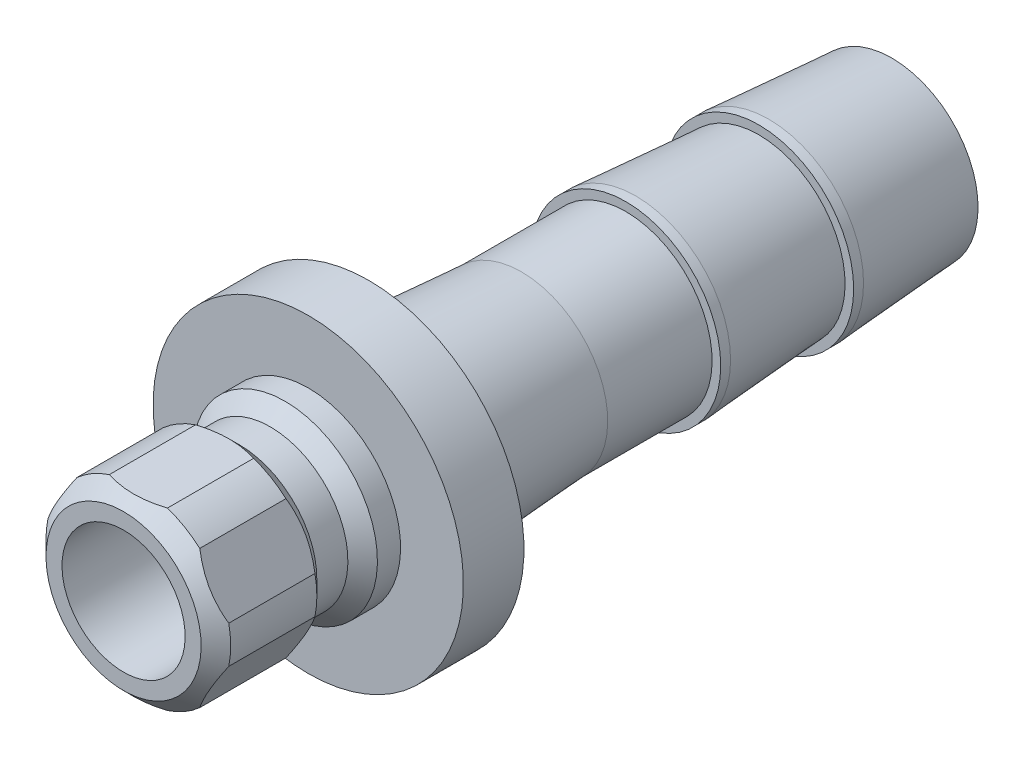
ISO-10303-21;
HEADER;
FILE_DESCRIPTION(('STEP AP214'),'2;1');
FILE_NAME('part.step','',(''),(''),'','','');
FILE_SCHEMA(('AUTOMOTIVE_DESIGN { 1 0 10303 214 1 1 1 1 }'));
ENDSEC;
DATA;
#1=APPLICATION_CONTEXT('core data for automotive mechanical design processes');
#2=APPLICATION_PROTOCOL_DEFINITION('international standard','automotive_design',2000,#1);
#3=PRODUCT_CONTEXT('',#1,'mechanical');
#4=PRODUCT('Part','Part','',(#3));
#5=PRODUCT_RELATED_PRODUCT_CATEGORY('part','',(#4));
#6=PRODUCT_DEFINITION_FORMATION('','',#4);
#7=PRODUCT_DEFINITION_CONTEXT('part definition',#1,'design');
#8=PRODUCT_DEFINITION('design','',#6,#7);
#9=PRODUCT_DEFINITION_SHAPE('','',#8);
#10=(LENGTH_UNIT() NAMED_UNIT(*) SI_UNIT(.MILLI.,.METRE.));
#11=(NAMED_UNIT(*) PLANE_ANGLE_UNIT() SI_UNIT($,.RADIAN.));
#12=(NAMED_UNIT(*) SI_UNIT($,.STERADIAN.) SOLID_ANGLE_UNIT());
#13=UNCERTAINTY_MEASURE_WITH_UNIT(LENGTH_MEASURE(1.E-05),#10,'distance_accuracy_value','');
#14=(GEOMETRIC_REPRESENTATION_CONTEXT(3) GLOBAL_UNCERTAINTY_ASSIGNED_CONTEXT((#13)) GLOBAL_UNIT_ASSIGNED_CONTEXT((#10,
#11,#12)) REPRESENTATION_CONTEXT('',''));
#15=CARTESIAN_POINT('',(0.,0.,0.));
#16=DIRECTION('',(0.,0.,1.));
#17=DIRECTION('',(1.,0.,0.));
#18=AXIS2_PLACEMENT_3D('',#15,#16,#17);
#19=CARTESIAN_POINT('',(0.,0.,8.763));
#20=DIRECTION('',(0.,0.,-1.));
#21=DIRECTION('',(0.,1.,0.));
#22=AXIS2_PLACEMENT_3D('',#19,#20,#21);
#23=CONICAL_SURFACE('',#22,4.7625,0.785398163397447);
#24=CARTESIAN_POINT('',(0.,0.,9.525));
#25=DIRECTION('',(0.,0.,-1.));
#26=DIRECTION('',(0.,1.,0.));
#27=AXIS2_PLACEMENT_3D('',#24,#25,#26);
#28=CIRCLE('',#27,4.0005);
#29=CARTESIAN_POINT('',(0.,4.0005,9.525));
#30=VERTEX_POINT('',#29);
#31=EDGE_CURVE('E162',#30,#30,#28,.T.);
#32=ORIENTED_EDGE('',*,*,#31,.T.);
#33=EDGE_LOOP('',(#32));
#34=FACE_BOUND('',#33,.T.);
#35=CARTESIAN_POINT('',(0.,0.,8.763));
#36=DIRECTION('',(0.,0.,-1.));
#37=DIRECTION('',(0.,1.,0.));
#38=AXIS2_PLACEMENT_3D('',#35,#36,#37);
#39=CIRCLE('',#38,4.7625);
#40=CARTESIAN_POINT('',(1.49671534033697,4.5212,8.763));
#41=VERTEX_POINT('',#40);
#42=CARTESIAN_POINT('',(3.16711638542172,3.55679350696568,8.763));
#43=VERTEX_POINT('',#42);
#44=EDGE_CURVE('E159',#41,#43,#39,.T.);
#45=ORIENTED_EDGE('',*,*,#44,.F.);
#46=CARTESIAN_POINT('',(-5.0602333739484,4.5212,6.73969045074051));
#47=CARTESIAN_POINT('',(-4.93634312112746,4.5212,6.83205528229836));
#48=CARTESIAN_POINT('',(-4.811743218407,4.5212,6.92348406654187));
#49=CARTESIAN_POINT('',(-4.56085059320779,4.5212,7.1040558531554));
#50=CARTESIAN_POINT('',(-4.43455743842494,4.5212,7.19319825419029));
#51=CARTESIAN_POINT('',(-4.17908222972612,4.5212,7.36941570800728));
#52=CARTESIAN_POINT('',(-4.04988536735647,4.5212,7.45646936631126));
#53=CARTESIAN_POINT('',(-3.78927482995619,4.5212,7.62718212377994));
#54=CARTESIAN_POINT('',(-3.65786131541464,4.5212,7.71084146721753));
#55=CARTESIAN_POINT('',(-3.38538701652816,4.5212,7.87838236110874));
#56=CARTESIAN_POINT('',(-3.24418594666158,4.5212,7.96203692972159));
#57=CARTESIAN_POINT('',(-2.95850534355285,4.5212,8.12363694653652));
#58=CARTESIAN_POINT('',(-2.81402531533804,4.5212,8.20158152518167));
#59=CARTESIAN_POINT('',(-2.52183304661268,4.5212,8.35006696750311));
#60=CARTESIAN_POINT('',(-2.37413195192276,4.5212,8.42062959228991));
#61=CARTESIAN_POINT('',(-2.07479760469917,4.5212,8.55277287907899));
#62=CARTESIAN_POINT('',(-1.92316611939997,4.5212,8.61435749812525));
#63=CARTESIAN_POINT('',(-1.62629805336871,4.5212,8.72254985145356));
#64=CARTESIAN_POINT('',(-1.48133250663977,4.5212,8.76989343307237));
#65=CARTESIAN_POINT('',(-1.18803884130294,4.5212,8.85292852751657));
#66=CARTESIAN_POINT('',(-1.03971047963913,4.5212,8.88861919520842));
#67=CARTESIAN_POINT('',(-0.742975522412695,4.5212,8.94593029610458));
#68=CARTESIAN_POINT('',(-0.594614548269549,4.5212,8.96778315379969));
#69=CARTESIAN_POINT('',(-0.296466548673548,4.5212,8.99701724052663));
#70=CARTESIAN_POINT('',(-0.146679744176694,4.5212,9.00440067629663));
#71=CARTESIAN_POINT('',(0.148070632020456,4.5212,9.00420046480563));
#72=CARTESIAN_POINT('',(0.293034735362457,4.5212,8.99708950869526));
#73=CARTESIAN_POINT('',(0.581648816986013,4.5212,8.96930433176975));
#74=CARTESIAN_POINT('',(0.72529866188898,4.5212,8.94862874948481));
#75=CARTESIAN_POINT('',(1.0126713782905,4.5212,8.89446534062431));
#76=CARTESIAN_POINT('',(1.15635345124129,4.5212,8.86076436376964));
#77=CARTESIAN_POINT('',(1.44060339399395,4.5212,8.78230373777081));
#78=CARTESIAN_POINT('',(1.58117157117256,4.5212,8.73754518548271));
#79=CARTESIAN_POINT('',(1.8753823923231,4.5212,8.63293184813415));
#80=CARTESIAN_POINT('',(2.02860927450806,4.5212,8.5719186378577));
#81=CARTESIAN_POINT('',(2.3310511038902,4.5212,8.44057368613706));
#82=CARTESIAN_POINT('',(2.48026409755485,4.5212,8.37023750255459));
#83=CARTESIAN_POINT('',(2.77542641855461,4.5212,8.22192506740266));
#84=CARTESIAN_POINT('',(2.92136343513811,4.5212,8.14392451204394));
#85=CARTESIAN_POINT('',(3.20986770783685,4.5212,7.98201287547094));
#86=CARTESIAN_POINT('',(3.35243550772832,4.5212,7.89810275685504));
#87=CARTESIAN_POINT('',(3.62758150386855,4.5212,7.72986772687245));
#88=CARTESIAN_POINT('',(3.76030215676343,4.5212,7.64577457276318));
#89=CARTESIAN_POINT('',(4.02346673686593,4.5212,7.47408734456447));
#90=CARTESIAN_POINT('',(4.1539104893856,4.5212,7.38649300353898));
#91=CARTESIAN_POINT('',(4.41175524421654,4.5212,7.20916168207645));
#92=CARTESIAN_POINT('',(4.5391724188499,4.5212,7.11944813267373));
#93=CARTESIAN_POINT('',(4.79227118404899,4.5212,6.93767494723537));
#94=CARTESIAN_POINT('',(4.91795324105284,4.5212,6.84561596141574));
#95=CARTESIAN_POINT('',(5.04290975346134,4.5212,6.75259898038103));
#96=B_SPLINE_CURVE_WITH_KNOTS('',3,(#46,#47,#48,#49,#50,#51,#52,#53,#54,#55,#56,#57,#58,#59,#60,
#61,#62,#63,#64,#65,#66,#67,#68,#69,#70,#71,#72,#73,#74,#75,#76,#77,#78,#79,#80,#81,#82,#83,#84,
#85,#86,#87,#88,#89,#90,#91,#92,#93,#94,#95),.UNSPECIFIED.,.F.,.F.,(4,2,2,2,2,2,2,2,2,2,2,2,2,2,
2,2,2,2,2,2,2,2,2,2,4),(0.,0.463604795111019,0.927330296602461,1.39465214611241,
1.86194030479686,2.35419709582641,2.84652869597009,3.33736544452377,3.82798519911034,
4.28507980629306,4.74220755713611,5.19143799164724,5.64059990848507,6.07534819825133,
6.51014013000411,6.9523708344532,7.39455768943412,7.88895068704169,8.38358010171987,
8.87983197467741,9.37600320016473,9.84729595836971,10.3186247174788,10.7860923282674,
11.253431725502),.UNSPECIFIED.);
#97=CARTESIAN_POINT('',(-1.49671534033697,4.5212,8.763));
#98=VERTEX_POINT('',#97);
#99=EDGE_CURVE('E320',#41,#98,#96,.F.);
#100=ORIENTED_EDGE('',*,*,#99,.T.);
#101=CARTESIAN_POINT('',(-3.16711638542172,3.55679350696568,8.763));
#102=VERTEX_POINT('',#101);
#103=EDGE_CURVE('E156',#102,#98,#39,.T.);
#104=ORIENTED_EDGE('',*,*,#103,.F.);
#105=CARTESIAN_POINT('',(-3.16679824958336,3.55734453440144,8.7628));
#106=CARTESIAN_POINT('',(-3.22352818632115,3.45908540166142,8.79849546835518));
#107=CARTESIAN_POINT('',(-3.28081452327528,3.35986255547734,8.83084024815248));
#108=CARTESIAN_POINT('',(-3.39638266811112,3.1596926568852,8.88798087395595));
#109=CARTESIAN_POINT('',(-3.45466549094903,3.0587438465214,8.91276847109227));
#110=CARTESIAN_POINT('',(-3.57062001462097,2.85790472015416,8.95338750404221));
#111=CARTESIAN_POINT('',(-3.62827437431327,2.75804443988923,8.96941393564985));
#112=CARTESIAN_POINT('',(-3.74399531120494,2.55760989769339,8.9927719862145));
#113=CARTESIAN_POINT('',(-3.80206167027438,2.45703601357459,9.0001079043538));
#114=CARTESIAN_POINT('',(-3.92728271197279,2.24014680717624,9.00622652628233));
#115=CARTESIAN_POINT('',(-3.99445711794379,2.1237973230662,9.00351464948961));
#116=CARTESIAN_POINT('',(-4.12846972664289,1.89168067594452,8.98624900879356));
#117=CARTESIAN_POINT('',(-4.19530762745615,1.77591403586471,8.97168604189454));
#118=CARTESIAN_POINT('',(-4.32994932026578,1.54270778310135,8.93091274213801));
#119=CARTESIAN_POINT('',(-4.39772926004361,1.42530948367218,8.90439364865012));
#120=CARTESIAN_POINT('',(-4.53197617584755,1.19278700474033,8.84101293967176));
#121=CARTESIAN_POINT('',(-4.59844486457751,1.07765985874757,8.80416592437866));
#122=CARTESIAN_POINT('',(-4.66414986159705,0.963855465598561,8.7628));
#123=B_SPLINE_CURVE_WITH_KNOTS('',3,(#105,#106,#107,#108,#109,#110,#111,#112,#113,#114,#115,
#116,#117,#118,#119,#120,#121,#122),.UNSPECIFIED.,.F.,.F.,(4,2,2,2,2,2,2,2,4),(0.,
0.356859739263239,0.714107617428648,1.06304196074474,1.41180361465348,1.81438443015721,
2.21727816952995,2.63123184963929,3.04460326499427),.UNSPECIFIED.);
#124=CARTESIAN_POINT('',(-4.66383172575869,0.964406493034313,8.763));
#125=VERTEX_POINT('',#124);
#126=EDGE_CURVE('E191',#102,#125,#123,.T.);
#127=ORIENTED_EDGE('',*,*,#126,.T.);
#128=CARTESIAN_POINT('',(-4.66383172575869,-0.964406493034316,8.763));
#129=VERTEX_POINT('',#128);
#130=EDGE_CURVE('E143',#129,#125,#39,.T.);
#131=ORIENTED_EDGE('',*,*,#130,.F.);
#132=CARTESIAN_POINT('',(-4.66414986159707,-0.963855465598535,8.76279999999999));
#133=CARTESIAN_POINT('',(-4.60741992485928,-1.06211459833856,8.79849546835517));
#134=CARTESIAN_POINT('',(-4.55013358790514,-1.16133744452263,8.83084024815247));
#135=CARTESIAN_POINT('',(-4.4345654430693,-1.36150734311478,8.88798087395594));
#136=CARTESIAN_POINT('',(-4.37628262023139,-1.46245615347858,8.91276847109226));
#137=CARTESIAN_POINT('',(-4.26032809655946,-1.66329527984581,8.95338750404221));
#138=CARTESIAN_POINT('',(-4.20267373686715,-1.76315556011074,8.96941393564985));
#139=CARTESIAN_POINT('',(-4.08695279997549,-1.96359010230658,8.9927719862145));
#140=CARTESIAN_POINT('',(-4.02888644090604,-2.06416398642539,9.0001079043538));
#141=CARTESIAN_POINT('',(-3.90366539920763,-2.28105319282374,9.00622652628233));
#142=CARTESIAN_POINT('',(-3.83649099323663,-2.39740267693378,9.00351464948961));
#143=CARTESIAN_POINT('',(-3.70247838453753,-2.62951932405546,8.98624900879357));
#144=CARTESIAN_POINT('',(-3.63564048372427,-2.74528596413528,8.97168604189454));
#145=CARTESIAN_POINT('',(-3.50099879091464,-2.97849221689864,8.93091274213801));
#146=CARTESIAN_POINT('',(-3.4332188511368,-3.09589051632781,8.90439364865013));
#147=CARTESIAN_POINT('',(-3.29897193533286,-3.32841299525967,8.84101293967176));
#148=CARTESIAN_POINT('',(-3.2325032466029,-3.44354014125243,8.80416592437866));
#149=CARTESIAN_POINT('',(-3.16679824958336,-3.55734453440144,8.7628));
#150=B_SPLINE_CURVE_WITH_KNOTS('',3,(#132,#133,#134,#135,#136,#137,#138,#139,#140,#141,#142,
#143,#144,#145,#146,#147,#148,#149),.UNSPECIFIED.,.F.,.F.,(4,2,2,2,2,2,2,2,4),(0.,
0.356859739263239,0.714107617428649,1.06304196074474,1.41180361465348,1.81438443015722,
2.21727816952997,2.63123184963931,3.0446032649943),.UNSPECIFIED.);
#151=CARTESIAN_POINT('',(-3.16711638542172,-3.55679350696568,8.763));
#152=VERTEX_POINT('',#151);
#153=EDGE_CURVE('E211',#129,#152,#150,.T.);
#154=ORIENTED_EDGE('',*,*,#153,.T.);
#155=CARTESIAN_POINT('',(-1.49671534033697,-4.5212,8.763));
#156=VERTEX_POINT('',#155);
#157=EDGE_CURVE('E289',#156,#152,#39,.T.);
#158=ORIENTED_EDGE('',*,*,#157,.F.);
#159=CARTESIAN_POINT('',(-5.0602333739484,-4.5212,6.73969045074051));
#160=CARTESIAN_POINT('',(-4.93634312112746,-4.5212,6.83205528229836));
#161=CARTESIAN_POINT('',(-4.81174321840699,-4.5212,6.92348406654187));
#162=CARTESIAN_POINT('',(-4.56085059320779,-4.5212,7.1040558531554));
#163=CARTESIAN_POINT('',(-4.43455743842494,-4.5212,7.19319825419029));
#164=CARTESIAN_POINT('',(-4.17908222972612,-4.5212,7.36941570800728));
#165=CARTESIAN_POINT('',(-4.04988536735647,-4.5212,7.45646936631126));
#166=CARTESIAN_POINT('',(-3.78927482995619,-4.5212,7.62718212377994));
#167=CARTESIAN_POINT('',(-3.65786131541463,-4.5212,7.71084146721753));
#168=CARTESIAN_POINT('',(-3.38538701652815,-4.5212,7.87838236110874));
#169=CARTESIAN_POINT('',(-3.24418594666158,-4.5212,7.96203692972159));
#170=CARTESIAN_POINT('',(-2.95850534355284,-4.5212,8.12363694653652));
#171=CARTESIAN_POINT('',(-2.81402531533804,-4.5212,8.20158152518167));
#172=CARTESIAN_POINT('',(-2.52183304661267,-4.5212,8.35006696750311));
#173=CARTESIAN_POINT('',(-2.37413195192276,-4.5212,8.42062959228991));
#174=CARTESIAN_POINT('',(-2.07479760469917,-4.5212,8.55277287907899));
#175=CARTESIAN_POINT('',(-1.92316611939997,-4.5212,8.61435749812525));
#176=CARTESIAN_POINT('',(-1.62629805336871,-4.5212,8.72254985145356));
#177=CARTESIAN_POINT('',(-1.48133250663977,-4.5212,8.76989343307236));
#178=CARTESIAN_POINT('',(-1.18803884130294,-4.5212,8.85292852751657));
#179=CARTESIAN_POINT('',(-1.03971047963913,-4.5212,8.88861919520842));
#180=CARTESIAN_POINT('',(-0.742975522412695,-4.5212,8.94593029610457));
#181=CARTESIAN_POINT('',(-0.594614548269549,-4.5212,8.96778315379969));
#182=CARTESIAN_POINT('',(-0.296466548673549,-4.5212,8.99701724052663));
#183=CARTESIAN_POINT('',(-0.146679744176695,-4.5212,9.00440067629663));
#184=CARTESIAN_POINT('',(0.148070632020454,-4.5212,9.00420046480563));
#185=CARTESIAN_POINT('',(0.293034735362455,-4.5212,8.99708950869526));
#186=CARTESIAN_POINT('',(0.581648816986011,-4.5212,8.96930433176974));
#187=CARTESIAN_POINT('',(0.725298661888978,-4.5212,8.94862874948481));
#188=CARTESIAN_POINT('',(1.0126713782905,-4.5212,8.89446534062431));
#189=CARTESIAN_POINT('',(1.15635345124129,-4.5212,8.86076436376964));
#190=CARTESIAN_POINT('',(1.44060339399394,-4.5212,8.78230373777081));
#191=CARTESIAN_POINT('',(1.58117157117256,-4.5212,8.73754518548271));
#192=CARTESIAN_POINT('',(1.8753823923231,-4.5212,8.63293184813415));
#193=CARTESIAN_POINT('',(2.02860927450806,-4.5212,8.5719186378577));
#194=CARTESIAN_POINT('',(2.3310511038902,-4.5212,8.44057368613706));
#195=CARTESIAN_POINT('',(2.48026409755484,-4.5212,8.37023750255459));
#196=CARTESIAN_POINT('',(2.77542641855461,-4.5212,8.22192506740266));
#197=CARTESIAN_POINT('',(2.9213634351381,-4.5212,8.14392451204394));
#198=CARTESIAN_POINT('',(3.20986770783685,-4.5212,7.98201287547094));
#199=CARTESIAN_POINT('',(3.35243550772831,-4.5212,7.89810275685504));
#200=CARTESIAN_POINT('',(3.62758150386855,-4.5212,7.72986772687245));
#201=CARTESIAN_POINT('',(3.76030215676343,-4.5212,7.64577457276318));
#202=CARTESIAN_POINT('',(4.02346673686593,-4.5212,7.47408734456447));
#203=CARTESIAN_POINT('',(4.15391048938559,-4.5212,7.38649300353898));
#204=CARTESIAN_POINT('',(4.41175524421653,-4.5212,7.20916168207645));
#205=CARTESIAN_POINT('',(4.5391724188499,-4.5212,7.11944813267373));
#206=CARTESIAN_POINT('',(4.79227118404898,-4.5212,6.93767494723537));
#207=CARTESIAN_POINT('',(4.91795324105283,-4.5212,6.84561596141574));
#208=CARTESIAN_POINT('',(5.04290975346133,-4.5212,6.75259898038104));
#209=B_SPLINE_CURVE_WITH_KNOTS('',3,(#159,#160,#161,#162,#163,#164,#165,#166,#167,#168,#169,
#170,#171,#172,#173,#174,#175,#176,#177,#178,#179,#180,#181,#182,#183,#184,#185,#186,#187,#188,
#189,#190,#191,#192,#193,#194,#195,#196,#197,#198,#199,#200,#201,#202,#203,#204,#205,#206,#207,
#208),.UNSPECIFIED.,.F.,.F.,(4,2,2,2,2,2,2,2,2,2,2,2,2,2,2,2,2,2,2,2,2,2,2,2,4),(0.,
0.463604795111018,0.927330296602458,1.3946521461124,1.86194030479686,2.35419709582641,
2.84652869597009,3.33736544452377,3.82798519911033,4.28507980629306,4.74220755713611,
5.19143799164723,5.64059990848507,6.07534819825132,6.5101401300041,6.95237083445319,
7.39455768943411,7.88895068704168,8.38358010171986,8.8798319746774,9.37600320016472,
9.8472959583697,10.3186247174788,10.7860923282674,11.2534317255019),.UNSPECIFIED.);
#210=CARTESIAN_POINT('',(1.49671534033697,-4.5212,8.763));
#211=VERTEX_POINT('',#210);
#212=EDGE_CURVE('E218',#156,#211,#209,.T.);
#213=ORIENTED_EDGE('',*,*,#212,.T.);
#214=CARTESIAN_POINT('',(3.16711638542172,-3.55679350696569,8.763));
#215=VERTEX_POINT('',#214);
#216=EDGE_CURVE('E297',#215,#211,#39,.T.);
#217=ORIENTED_EDGE('',*,*,#216,.F.);
#218=CARTESIAN_POINT('',(3.16679824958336,-3.55734453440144,8.7628));
#219=CARTESIAN_POINT('',(3.22352818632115,-3.45908540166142,8.79849546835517));
#220=CARTESIAN_POINT('',(3.28081452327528,-3.35986255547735,8.83084024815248));
#221=CARTESIAN_POINT('',(3.39638266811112,-3.1596926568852,8.88798087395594));
#222=CARTESIAN_POINT('',(3.45466549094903,-3.0587438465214,8.91276847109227));
#223=CARTESIAN_POINT('',(3.57062001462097,-2.85790472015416,8.95338750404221));
#224=CARTESIAN_POINT('',(3.62827437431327,-2.75804443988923,8.96941393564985));
#225=CARTESIAN_POINT('',(3.74399531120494,-2.5576098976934,8.9927719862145));
#226=CARTESIAN_POINT('',(3.80206167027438,-2.45703601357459,9.0001079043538));
#227=CARTESIAN_POINT('',(3.92728271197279,-2.24014680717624,9.00622652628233));
#228=CARTESIAN_POINT('',(3.9944571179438,-2.1237973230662,9.00351464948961));
#229=CARTESIAN_POINT('',(4.1284697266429,-1.89168067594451,8.98624900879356));
#230=CARTESIAN_POINT('',(4.19530762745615,-1.7759140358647,8.97168604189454));
#231=CARTESIAN_POINT('',(4.32994932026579,-1.54270778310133,8.93091274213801));
#232=CARTESIAN_POINT('',(4.39772926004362,-1.42530948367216,8.90439364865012));
#233=CARTESIAN_POINT('',(4.53197617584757,-1.19278700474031,8.84101293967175));
#234=CARTESIAN_POINT('',(4.59844486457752,-1.07765985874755,8.80416592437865));
#235=CARTESIAN_POINT('',(4.66414986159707,-0.963855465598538,8.76279999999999));
#236=B_SPLINE_CURVE_WITH_KNOTS('',3,(#218,#219,#220,#221,#222,#223,#224,#225,#226,#227,#228,
#229,#230,#231,#232,#233,#234,#235),.UNSPECIFIED.,.F.,.F.,(4,2,2,2,2,2,2,2,4),(0.,
0.356859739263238,0.714107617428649,1.06304196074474,1.41180361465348,1.81438443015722,
2.21727816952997,2.63123184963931,3.0446032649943),.UNSPECIFIED.);
#237=CARTESIAN_POINT('',(4.66383172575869,-0.964406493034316,8.763));
#238=VERTEX_POINT('',#237);
#239=EDGE_CURVE('E225',#215,#238,#236,.T.);
#240=ORIENTED_EDGE('',*,*,#239,.T.);
#241=CARTESIAN_POINT('',(4.66383172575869,0.964406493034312,8.763));
#242=VERTEX_POINT('',#241);
#243=EDGE_CURVE('E163',#242,#238,#39,.T.);
#244=ORIENTED_EDGE('',*,*,#243,.F.);
#245=CARTESIAN_POINT('',(4.66414986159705,0.963855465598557,8.7628));
#246=CARTESIAN_POINT('',(4.60741992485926,1.06211459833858,8.79849546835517));
#247=CARTESIAN_POINT('',(4.55013358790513,1.16133744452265,8.83084024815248));
#248=CARTESIAN_POINT('',(4.43456544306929,1.3615073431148,8.88798087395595));
#249=CARTESIAN_POINT('',(4.37628262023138,1.4624561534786,8.91276847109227));
#250=CARTESIAN_POINT('',(4.26032809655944,1.66329527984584,8.95338750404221));
#251=CARTESIAN_POINT('',(4.20267373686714,1.76315556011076,8.96941393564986));
#252=CARTESIAN_POINT('',(4.08695279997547,1.9635901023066,8.99277198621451));
#253=CARTESIAN_POINT('',(4.02888644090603,2.06416398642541,9.0001079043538));
#254=CARTESIAN_POINT('',(3.90366539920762,2.28105319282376,9.00622652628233));
#255=CARTESIAN_POINT('',(3.83649099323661,2.3974026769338,9.00351464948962));
#256=CARTESIAN_POINT('',(3.70247838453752,2.62951932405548,8.98624900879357));
#257=CARTESIAN_POINT('',(3.63564048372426,2.74528596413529,8.97168604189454));
#258=CARTESIAN_POINT('',(3.50099879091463,2.97849221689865,8.93091274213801));
#259=CARTESIAN_POINT('',(3.43321885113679,3.09589051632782,8.90439364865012));
#260=CARTESIAN_POINT('',(3.29897193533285,3.32841299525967,8.84101293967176));
#261=CARTESIAN_POINT('',(3.2325032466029,3.44354014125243,8.80416592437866));
#262=CARTESIAN_POINT('',(3.16679824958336,3.55734453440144,8.7628));
#263=B_SPLINE_CURVE_WITH_KNOTS('',3,(#245,#246,#247,#248,#249,#250,#251,#252,#253,#254,#255,
#256,#257,#258,#259,#260,#261,#262),.UNSPECIFIED.,.F.,.F.,(4,2,2,2,2,2,2,2,4),(0.,
0.356859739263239,0.714107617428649,1.06304196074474,1.41180361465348,1.81438443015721,
2.21727816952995,2.63123184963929,3.04460326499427),.UNSPECIFIED.);
#264=EDGE_CURVE('E233',#242,#43,#263,.T.);
#265=ORIENTED_EDGE('',*,*,#264,.T.);
#266=EDGE_LOOP('',(#45,#100,#104,#127,#131,#154,#158,#213,#217,#240,#244,#265));
#267=FACE_BOUND('',#266,.T.);
#268=ADVANCED_FACE('F34',(#34,#267),#23,.T.);
#269=CARTESIAN_POINT('',(0.,0.,0.));
#270=DIRECTION('',(0.,0.,-1.));
#271=DIRECTION('',(0.,1.,0.));
#272=AXIS2_PLACEMENT_3D('',#269,#270,#271);
#273=CYLINDRICAL_SURFACE('',#272,4.7625);
#274=CARTESIAN_POINT('',(0.,0.,4.318));
#275=DIRECTION('',(0.,0.,-1.));
#276=DIRECTION('',(0.,1.,0.));
#277=AXIS2_PLACEMENT_3D('',#274,#275,#276);
#278=CIRCLE('',#277,4.7625);
#279=CARTESIAN_POINT('',(1.49671534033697,4.5212,4.318));
#280=VERTEX_POINT('',#279);
#281=CARTESIAN_POINT('',(3.16711638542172,3.55679350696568,4.318));
#282=VERTEX_POINT('',#281);
#283=EDGE_CURVE('E152',#280,#282,#278,.T.);
#284=ORIENTED_EDGE('',*,*,#283,.F.);
#285=DIRECTION('',(0.,0.,-1.));
#286=VECTOR('',#285,1.);
#287=CARTESIAN_POINT('',(1.49671534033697,4.5212,0.));
#288=LINE('',#287,#286);
#289=EDGE_CURVE('E324',#280,#41,#288,.F.);
#290=ORIENTED_EDGE('',*,*,#289,.T.);
#291=ORIENTED_EDGE('',*,*,#44,.T.);
#292=DIRECTION('',(0.,0.,-1.));
#293=VECTOR('',#292,1.);
#294=CARTESIAN_POINT('',(3.16711638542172,3.55679350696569,0.));
#295=LINE('',#294,#293);
#296=EDGE_CURVE('E307',#43,#282,#295,.T.);
#297=ORIENTED_EDGE('',*,*,#296,.T.);
#298=EDGE_LOOP('',(#284,#290,#291,#297));
#299=FACE_BOUND('',#298,.T.);
#300=ADVANCED_FACE('F202',(#299),#273,.T.);
#301=ORIENTED_EDGE('',*,*,#103,.T.);
#302=DIRECTION('',(0.,0.,-1.));
#303=VECTOR('',#302,1.);
#304=CARTESIAN_POINT('',(-1.49671534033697,4.5212,0.));
#305=LINE('',#304,#303);
#306=CARTESIAN_POINT('',(-1.4967153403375,4.5212,4.31799999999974));
#307=VERTEX_POINT('',#306);
#308=EDGE_CURVE('E241',#98,#307,#305,.T.);
#309=ORIENTED_EDGE('',*,*,#308,.T.);
#310=CARTESIAN_POINT('',(-3.16711638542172,3.55679350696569,4.318));
#311=VERTEX_POINT('',#310);
#312=EDGE_CURVE('E148',#311,#307,#278,.T.);
#313=ORIENTED_EDGE('',*,*,#312,.F.);
#314=DIRECTION('',(0.,0.,-1.));
#315=VECTOR('',#314,1.);
#316=CARTESIAN_POINT('',(-3.16711638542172,3.55679350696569,0.));
#317=LINE('',#316,#315);
#318=EDGE_CURVE('E54',#311,#102,#317,.F.);
#319=ORIENTED_EDGE('',*,*,#318,.T.);
#320=EDGE_LOOP('',(#301,#309,#313,#319));
#321=FACE_BOUND('',#320,.T.);
#322=ADVANCED_FACE('F318',(#321),#273,.T.);
#323=CARTESIAN_POINT('',(4.66383172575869,0.964406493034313,4.318));
#324=VERTEX_POINT('',#323);
#325=CARTESIAN_POINT('',(4.66383172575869,-0.964406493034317,4.318));
#326=VERTEX_POINT('',#325);
#327=EDGE_CURVE('E157',#324,#326,#278,.T.);
#328=ORIENTED_EDGE('',*,*,#327,.F.);
#329=DIRECTION('',(0.,0.,-1.));
#330=VECTOR('',#329,1.);
#331=CARTESIAN_POINT('',(4.66383172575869,0.964406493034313,0.));
#332=LINE('',#331,#330);
#333=EDGE_CURVE('E242',#324,#242,#332,.F.);
#334=ORIENTED_EDGE('',*,*,#333,.T.);
#335=ORIENTED_EDGE('',*,*,#243,.T.);
#336=DIRECTION('',(0.,0.,-1.));
#337=VECTOR('',#336,1.);
#338=CARTESIAN_POINT('',(4.66383172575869,-0.964406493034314,0.));
#339=LINE('',#338,#337);
#340=EDGE_CURVE('E300',#238,#326,#339,.T.);
#341=ORIENTED_EDGE('',*,*,#340,.T.);
#342=EDGE_LOOP('',(#328,#334,#335,#341));
#343=FACE_BOUND('',#342,.T.);
#344=ADVANCED_FACE('F313',(#343),#273,.T.);
#345=CARTESIAN_POINT('',(3.16711638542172,-3.55679350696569,4.318));
#346=VERTEX_POINT('',#345);
#347=CARTESIAN_POINT('',(1.49671534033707,-4.5212,4.31799999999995));
#348=VERTEX_POINT('',#347);
#349=EDGE_CURVE('E150',#346,#348,#278,.T.);
#350=ORIENTED_EDGE('',*,*,#349,.F.);
#351=DIRECTION('',(0.,0.,-1.));
#352=VECTOR('',#351,1.);
#353=CARTESIAN_POINT('',(3.16711638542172,-3.55679350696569,0.));
#354=LINE('',#353,#352);
#355=EDGE_CURVE('E302',#346,#215,#354,.F.);
#356=ORIENTED_EDGE('',*,*,#355,.T.);
#357=ORIENTED_EDGE('',*,*,#216,.T.);
#358=DIRECTION('',(0.,0.,-1.));
#359=VECTOR('',#358,1.);
#360=CARTESIAN_POINT('',(1.49671534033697,-4.5212,0.));
#361=LINE('',#360,#359);
#362=EDGE_CURVE('E284',#211,#348,#361,.T.);
#363=ORIENTED_EDGE('',*,*,#362,.T.);
#364=EDGE_LOOP('',(#350,#356,#357,#363));
#365=FACE_BOUND('',#364,.T.);
#366=ADVANCED_FACE('F294',(#365),#273,.T.);
#367=CARTESIAN_POINT('',(-1.49671534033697,-4.5212,4.318));
#368=VERTEX_POINT('',#367);
#369=CARTESIAN_POINT('',(-3.16711638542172,-3.55679350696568,4.318));
#370=VERTEX_POINT('',#369);
#371=EDGE_CURVE('E147',#368,#370,#278,.T.);
#372=ORIENTED_EDGE('',*,*,#371,.F.);
#373=DIRECTION('',(0.,0.,-1.));
#374=VECTOR('',#373,1.);
#375=CARTESIAN_POINT('',(-1.49671534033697,-4.5212,0.));
#376=LINE('',#375,#374);
#377=EDGE_CURVE('E277',#368,#156,#376,.F.);
#378=ORIENTED_EDGE('',*,*,#377,.T.);
#379=ORIENTED_EDGE('',*,*,#157,.T.);
#380=DIRECTION('',(0.,0.,-1.));
#381=VECTOR('',#380,1.);
#382=CARTESIAN_POINT('',(-3.16711638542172,-3.55679350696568,0.));
#383=LINE('',#382,#381);
#384=EDGE_CURVE('E198',#152,#370,#383,.T.);
#385=ORIENTED_EDGE('',*,*,#384,.T.);
#386=EDGE_LOOP('',(#372,#378,#379,#385));
#387=FACE_BOUND('',#386,.T.);
#388=ADVANCED_FACE('F288',(#387),#273,.T.);
#389=CARTESIAN_POINT('',(-4.66383172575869,-0.964406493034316,4.318));
#390=VERTEX_POINT('',#389);
#391=CARTESIAN_POINT('',(-4.66383172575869,0.964406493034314,4.318));
#392=VERTEX_POINT('',#391);
#393=EDGE_CURVE('E141',#390,#392,#278,.T.);
#394=ORIENTED_EDGE('',*,*,#393,.F.);
#395=DIRECTION('',(0.,0.,-1.));
#396=VECTOR('',#395,1.);
#397=CARTESIAN_POINT('',(-4.66383172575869,-0.964406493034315,0.));
#398=LINE('',#397,#396);
#399=EDGE_CURVE('E62',#390,#129,#398,.F.);
#400=ORIENTED_EDGE('',*,*,#399,.T.);
#401=ORIENTED_EDGE('',*,*,#130,.T.);
#402=DIRECTION('',(0.,0.,-1.));
#403=VECTOR('',#402,1.);
#404=CARTESIAN_POINT('',(-4.66383172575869,0.964406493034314,0.));
#405=LINE('',#404,#403);
#406=EDGE_CURVE('E128',#125,#392,#405,.T.);
#407=ORIENTED_EDGE('',*,*,#406,.T.);
#408=EDGE_LOOP('',(#394,#400,#401,#407));
#409=FACE_BOUND('',#408,.T.);
#410=ADVANCED_FACE('F140',(#409),#273,.T.);
#411=CARTESIAN_POINT('',(0.,0.,3.556));
#412=DIRECTION('',(0.,0.,1.));
#413=DIRECTION('',(0.,-1.,0.));
#414=AXIS2_PLACEMENT_3D('',#411,#412,#413);
#415=CONICAL_SURFACE('',#414,4.0005,0.785398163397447);
#416=CARTESIAN_POINT('',(0.,0.,3.556));
#417=DIRECTION('',(0.,0.,-1.));
#418=DIRECTION('',(0.,1.,0.));
#419=AXIS2_PLACEMENT_3D('',#416,#417,#418);
#420=CIRCLE('',#419,4.0005);
#421=CARTESIAN_POINT('',(0.,4.0005,3.556));
#422=VERTEX_POINT('',#421);
#423=EDGE_CURVE('E151',#422,#422,#420,.T.);
#424=ORIENTED_EDGE('',*,*,#423,.F.);
#425=EDGE_LOOP('',(#424));
#426=FACE_BOUND('',#425,.T.);
#427=ORIENTED_EDGE('',*,*,#312,.T.);
#428=CARTESIAN_POINT('',(-5.0602333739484,4.5212,6.34130954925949));
#429=CARTESIAN_POINT('',(-4.93634312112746,4.5212,6.24894471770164));
#430=CARTESIAN_POINT('',(-4.811743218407,4.5212,6.15751593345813));
#431=CARTESIAN_POINT('',(-4.56085059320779,4.5212,5.9769441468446));
#432=CARTESIAN_POINT('',(-4.43455743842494,4.5212,5.88780174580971));
#433=CARTESIAN_POINT('',(-4.17908222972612,4.5212,5.71158429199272));
#434=CARTESIAN_POINT('',(-4.04988536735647,4.5212,5.62453063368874));
#435=CARTESIAN_POINT('',(-3.78927482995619,4.5212,5.45381787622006));
#436=CARTESIAN_POINT('',(-3.65786131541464,4.5212,5.37015853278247));
#437=CARTESIAN_POINT('',(-3.38538701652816,4.5212,5.20261763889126));
#438=CARTESIAN_POINT('',(-3.24418594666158,4.5212,5.11896307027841));
#439=CARTESIAN_POINT('',(-2.95850534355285,4.5212,4.95736305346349));
#440=CARTESIAN_POINT('',(-2.81402531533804,4.5212,4.87941847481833));
#441=CARTESIAN_POINT('',(-2.52183304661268,4.5212,4.73093303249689));
#442=CARTESIAN_POINT('',(-2.37413195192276,4.5212,4.66037040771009));
#443=CARTESIAN_POINT('',(-2.07479760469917,4.5212,4.52822712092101));
#444=CARTESIAN_POINT('',(-1.92316611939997,4.5212,4.46664250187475));
#445=CARTESIAN_POINT('',(-1.62629805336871,4.5212,4.35845014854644));
#446=CARTESIAN_POINT('',(-1.48133250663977,4.5212,4.31110656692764));
#447=CARTESIAN_POINT('',(-1.18803884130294,4.5212,4.22807147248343));
#448=CARTESIAN_POINT('',(-1.03971047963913,4.5212,4.19238080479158));
#449=CARTESIAN_POINT('',(-0.742975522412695,4.5212,4.13506970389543));
#450=CARTESIAN_POINT('',(-0.594614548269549,4.5212,4.11321684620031));
#451=CARTESIAN_POINT('',(-0.296466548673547,4.5212,4.08398275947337));
#452=CARTESIAN_POINT('',(-0.146679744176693,4.5212,4.07659932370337));
#453=CARTESIAN_POINT('',(0.148070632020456,4.5212,4.07679953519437));
#454=CARTESIAN_POINT('',(0.293034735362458,4.5212,4.08391049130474));
#455=CARTESIAN_POINT('',(0.581648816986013,4.5212,4.11169566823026));
#456=CARTESIAN_POINT('',(0.72529866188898,4.5212,4.13237125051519));
#457=CARTESIAN_POINT('',(1.0126713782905,4.5212,4.18653465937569));
#458=CARTESIAN_POINT('',(1.15635345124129,4.5212,4.22023563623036));
#459=CARTESIAN_POINT('',(1.44060339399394,4.5212,4.29869626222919));
#460=CARTESIAN_POINT('',(1.58117157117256,4.5212,4.34345481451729));
#461=CARTESIAN_POINT('',(1.8753823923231,4.5212,4.44806815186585));
#462=CARTESIAN_POINT('',(2.02860927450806,4.5212,4.5090813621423));
#463=CARTESIAN_POINT('',(2.3310511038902,4.5212,4.64042631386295));
#464=CARTESIAN_POINT('',(2.48026409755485,4.5212,4.71076249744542));
#465=CARTESIAN_POINT('',(2.77542641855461,4.5212,4.85907493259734));
#466=CARTESIAN_POINT('',(2.92136343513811,4.5212,4.93707548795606));
#467=CARTESIAN_POINT('',(3.20986770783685,4.5212,5.09898712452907));
#468=CARTESIAN_POINT('',(3.35243550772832,4.5212,5.18289724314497));
#469=CARTESIAN_POINT('',(3.62758150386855,4.5212,5.35113227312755));
#470=CARTESIAN_POINT('',(3.76030215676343,4.5212,5.43522542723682));
#471=CARTESIAN_POINT('',(4.02346673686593,4.5212,5.60691265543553));
#472=CARTESIAN_POINT('',(4.1539104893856,4.5212,5.69450699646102));
#473=CARTESIAN_POINT('',(4.41175524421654,4.5212,5.87183831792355));
#474=CARTESIAN_POINT('',(4.5391724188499,4.5212,5.96155186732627));
#475=CARTESIAN_POINT('',(4.79227118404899,4.5212,6.14332505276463));
#476=CARTESIAN_POINT('',(4.91795324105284,4.5212,6.23538403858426));
#477=CARTESIAN_POINT('',(5.04290975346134,4.5212,6.32840101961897));
#478=B_SPLINE_CURVE_WITH_KNOTS('',3,(#428,#429,#430,#431,#432,#433,#434,#435,#436,#437,#438,
#439,#440,#441,#442,#443,#444,#445,#446,#447,#448,#449,#450,#451,#452,#453,#454,#455,#456,#457,
#458,#459,#460,#461,#462,#463,#464,#465,#466,#467,#468,#469,#470,#471,#472,#473,#474,#475,#476,
#477),.UNSPECIFIED.,.F.,.F.,(4,2,2,2,2,2,2,2,2,2,2,2,2,2,2,2,2,2,2,2,2,2,2,2,4),(0.,
0.463604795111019,0.92733029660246,1.39465214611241,1.86194030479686,2.35419709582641,
2.84652869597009,3.33736544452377,3.82798519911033,4.28507980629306,4.74220755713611,
5.19143799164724,5.64059990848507,6.07534819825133,6.51014013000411,6.9523708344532,
7.39455768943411,7.88895068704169,8.38358010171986,8.87983197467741,9.37600320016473,
9.84729595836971,10.3186247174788,10.7860923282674,11.253431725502),.UNSPECIFIED.);
#479=EDGE_CURVE('E12',#307,#280,#478,.T.);
#480=ORIENTED_EDGE('',*,*,#479,.T.);
#481=ORIENTED_EDGE('',*,*,#283,.T.);
#482=CARTESIAN_POINT('',(3.16679824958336,3.55734453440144,4.3182));
#483=CARTESIAN_POINT('',(3.22352818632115,3.45908540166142,4.28250453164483));
#484=CARTESIAN_POINT('',(3.28081452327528,3.35986255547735,4.25015975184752));
#485=CARTESIAN_POINT('',(3.39638266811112,3.1596926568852,4.19301912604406));
#486=CARTESIAN_POINT('',(3.45466549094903,3.0587438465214,4.16823152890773));
#487=CARTESIAN_POINT('',(3.57062001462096,2.85790472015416,4.12761249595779));
#488=CARTESIAN_POINT('',(3.62827437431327,2.75804443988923,4.11158606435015));
#489=CARTESIAN_POINT('',(3.74399531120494,2.5576098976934,4.0882280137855));
#490=CARTESIAN_POINT('',(3.80206167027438,2.45703601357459,4.0808920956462));
#491=CARTESIAN_POINT('',(3.92728271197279,2.24014680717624,4.07477347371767));
#492=CARTESIAN_POINT('',(3.99445711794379,2.1237973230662,4.07748535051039));
#493=CARTESIAN_POINT('',(4.12846972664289,1.89168067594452,4.09475099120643));
#494=CARTESIAN_POINT('',(4.19530762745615,1.77591403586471,4.10931395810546));
#495=CARTESIAN_POINT('',(4.32994932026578,1.54270778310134,4.15008725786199));
#496=CARTESIAN_POINT('',(4.39772926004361,1.42530948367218,4.17660635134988));
#497=CARTESIAN_POINT('',(4.53197617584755,1.19278700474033,4.23998706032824));
#498=CARTESIAN_POINT('',(4.59844486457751,1.07765985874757,4.27683407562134));
#499=CARTESIAN_POINT('',(4.66414986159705,0.963855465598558,4.3182));
#500=B_SPLINE_CURVE_WITH_KNOTS('',3,(#482,#483,#484,#485,#486,#487,#488,#489,#490,#491,#492,
#493,#494,#495,#496,#497,#498,#499),.UNSPECIFIED.,.F.,.F.,(4,2,2,2,2,2,2,2,4),(0.,
0.356859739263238,0.714107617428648,1.06304196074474,1.41180361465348,1.81438443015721,
2.21727816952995,2.63123184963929,3.04460326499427),.UNSPECIFIED.);
#501=EDGE_CURVE('E47',#282,#324,#500,.T.);
#502=ORIENTED_EDGE('',*,*,#501,.T.);
#503=ORIENTED_EDGE('',*,*,#327,.T.);
#504=CARTESIAN_POINT('',(4.66414986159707,-0.963855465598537,4.31820000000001));
#505=CARTESIAN_POINT('',(4.60741992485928,-1.06211459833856,4.28250453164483));
#506=CARTESIAN_POINT('',(4.55013358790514,-1.16133744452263,4.25015975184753));
#507=CARTESIAN_POINT('',(4.4345654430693,-1.36150734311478,4.19301912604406));
#508=CARTESIAN_POINT('',(4.37628262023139,-1.46245615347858,4.16823152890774));
#509=CARTESIAN_POINT('',(4.26032809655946,-1.66329527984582,4.12761249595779));
#510=CARTESIAN_POINT('',(4.20267373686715,-1.76315556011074,4.11158606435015));
#511=CARTESIAN_POINT('',(4.08695279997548,-1.96359010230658,4.0882280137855));
#512=CARTESIAN_POINT('',(4.02888644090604,-2.06416398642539,4.08089209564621));
#513=CARTESIAN_POINT('',(3.90366539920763,-2.28105319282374,4.07477347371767));
#514=CARTESIAN_POINT('',(3.83649099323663,-2.39740267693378,4.07748535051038));
#515=CARTESIAN_POINT('',(3.70247838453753,-2.62951932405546,4.09475099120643));
#516=CARTESIAN_POINT('',(3.63564048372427,-2.74528596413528,4.10931395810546));
#517=CARTESIAN_POINT('',(3.50099879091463,-2.97849221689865,4.15008725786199));
#518=CARTESIAN_POINT('',(3.4332188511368,-3.09589051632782,4.17660635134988));
#519=CARTESIAN_POINT('',(3.29897193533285,-3.32841299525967,4.23998706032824));
#520=CARTESIAN_POINT('',(3.2325032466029,-3.44354014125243,4.27683407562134));
#521=CARTESIAN_POINT('',(3.16679824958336,-3.55734453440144,4.3182));
#522=B_SPLINE_CURVE_WITH_KNOTS('',3,(#504,#505,#506,#507,#508,#509,#510,#511,#512,#513,#514,
#515,#516,#517,#518,#519,#520,#521),.UNSPECIFIED.,.F.,.F.,(4,2,2,2,2,2,2,2,4),(0.,
0.356859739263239,0.71410761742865,1.06304196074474,1.41180361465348,1.81438443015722,
2.21727816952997,2.63123184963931,3.0446032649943),.UNSPECIFIED.);
#523=EDGE_CURVE('E256',#326,#346,#522,.T.);
#524=ORIENTED_EDGE('',*,*,#523,.T.);
#525=ORIENTED_EDGE('',*,*,#349,.T.);
#526=CARTESIAN_POINT('',(-5.0602333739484,-4.5212,6.34130954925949));
#527=CARTESIAN_POINT('',(-4.93634312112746,-4.5212,6.24894471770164));
#528=CARTESIAN_POINT('',(-4.811743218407,-4.5212,6.15751593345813));
#529=CARTESIAN_POINT('',(-4.56085059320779,-4.5212,5.9769441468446));
#530=CARTESIAN_POINT('',(-4.43455743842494,-4.5212,5.88780174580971));
#531=CARTESIAN_POINT('',(-4.17908222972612,-4.5212,5.71158429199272));
#532=CARTESIAN_POINT('',(-4.04988536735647,-4.5212,5.62453063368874));
#533=CARTESIAN_POINT('',(-3.78927482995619,-4.5212,5.45381787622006));
#534=CARTESIAN_POINT('',(-3.65786131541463,-4.5212,5.37015853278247));
#535=CARTESIAN_POINT('',(-3.38538701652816,-4.5212,5.20261763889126));
#536=CARTESIAN_POINT('',(-3.24418594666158,-4.5212,5.11896307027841));
#537=CARTESIAN_POINT('',(-2.95850534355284,-4.5212,4.95736305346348));
#538=CARTESIAN_POINT('',(-2.81402531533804,-4.5212,4.87941847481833));
#539=CARTESIAN_POINT('',(-2.52183304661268,-4.5212,4.73093303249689));
#540=CARTESIAN_POINT('',(-2.37413195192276,-4.5212,4.66037040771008));
#541=CARTESIAN_POINT('',(-2.07479760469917,-4.5212,4.52822712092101));
#542=CARTESIAN_POINT('',(-1.92316611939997,-4.5212,4.46664250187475));
#543=CARTESIAN_POINT('',(-1.62629805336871,-4.5212,4.35845014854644));
#544=CARTESIAN_POINT('',(-1.48133250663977,-4.5212,4.31110656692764));
#545=CARTESIAN_POINT('',(-1.18803884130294,-4.5212,4.22807147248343));
#546=CARTESIAN_POINT('',(-1.03971047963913,-4.5212,4.19238080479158));
#547=CARTESIAN_POINT('',(-0.742975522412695,-4.5212,4.13506970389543));
#548=CARTESIAN_POINT('',(-0.594614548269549,-4.5212,4.11321684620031));
#549=CARTESIAN_POINT('',(-0.296466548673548,-4.5212,4.08398275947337));
#550=CARTESIAN_POINT('',(-0.146679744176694,-4.5212,4.07659932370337));
#551=CARTESIAN_POINT('',(0.148070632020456,-4.5212,4.07679953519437));
#552=CARTESIAN_POINT('',(0.293034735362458,-4.5212,4.08391049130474));
#553=CARTESIAN_POINT('',(0.581648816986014,-4.5212,4.11169566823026));
#554=CARTESIAN_POINT('',(0.725298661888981,-4.5212,4.13237125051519));
#555=CARTESIAN_POINT('',(1.0126713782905,-4.5212,4.18653465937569));
#556=CARTESIAN_POINT('',(1.15635345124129,-4.5212,4.22023563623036));
#557=CARTESIAN_POINT('',(1.44060339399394,-4.5212,4.29869626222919));
#558=CARTESIAN_POINT('',(1.58117157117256,-4.5212,4.34345481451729));
#559=CARTESIAN_POINT('',(1.8753823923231,-4.5212,4.44806815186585));
#560=CARTESIAN_POINT('',(2.02860927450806,-4.5212,4.50908136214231));
#561=CARTESIAN_POINT('',(2.3310511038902,-4.5212,4.64042631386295));
#562=CARTESIAN_POINT('',(2.48026409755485,-4.5212,4.71076249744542));
#563=CARTESIAN_POINT('',(2.77542641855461,-4.5212,4.85907493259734));
#564=CARTESIAN_POINT('',(2.92136343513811,-4.5212,4.93707548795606));
#565=CARTESIAN_POINT('',(3.20986770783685,-4.5212,5.09898712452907));
#566=CARTESIAN_POINT('',(3.35243550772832,-4.5212,5.18289724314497));
#567=CARTESIAN_POINT('',(3.62758150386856,-4.5212,5.35113227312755));
#568=CARTESIAN_POINT('',(3.76030215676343,-4.5212,5.43522542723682));
#569=CARTESIAN_POINT('',(4.02346673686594,-4.5212,5.60691265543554));
#570=CARTESIAN_POINT('',(4.1539104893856,-4.5212,5.69450699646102));
#571=CARTESIAN_POINT('',(4.41175524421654,-4.5212,5.87183831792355));
#572=CARTESIAN_POINT('',(4.53917241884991,-4.5212,5.96155186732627));
#573=CARTESIAN_POINT('',(4.79227118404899,-4.5212,6.14332505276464));
#574=CARTESIAN_POINT('',(4.91795324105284,-4.5212,6.23538403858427));
#575=CARTESIAN_POINT('',(5.04290975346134,-4.5212,6.32840101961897));
#576=B_SPLINE_CURVE_WITH_KNOTS('',3,(#526,#527,#528,#529,#530,#531,#532,#533,#534,#535,#536,
#537,#538,#539,#540,#541,#542,#543,#544,#545,#546,#547,#548,#549,#550,#551,#552,#553,#554,#555,
#556,#557,#558,#559,#560,#561,#562,#563,#564,#565,#566,#567,#568,#569,#570,#571,#572,#573,#574,
#575),.UNSPECIFIED.,.F.,.F.,(4,2,2,2,2,2,2,2,2,2,2,2,2,2,2,2,2,2,2,2,2,2,2,2,4),(0.,
0.463604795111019,0.927330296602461,1.39465214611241,1.86194030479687,2.35419709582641,
2.84652869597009,3.33736544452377,3.82798519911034,4.28507980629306,4.74220755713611,
5.19143799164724,5.64059990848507,6.07534819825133,6.51014013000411,6.9523708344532,
7.39455768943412,7.88895068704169,8.38358010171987,8.87983197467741,9.37600320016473,
9.84729595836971,10.3186247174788,10.7860923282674,11.253431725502),.UNSPECIFIED.);
#577=EDGE_CURVE('E261',#348,#368,#576,.F.);
#578=ORIENTED_EDGE('',*,*,#577,.T.);
#579=ORIENTED_EDGE('',*,*,#371,.T.);
#580=CARTESIAN_POINT('',(-3.16679824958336,-3.55734453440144,4.3182));
#581=CARTESIAN_POINT('',(-3.22352818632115,-3.45908540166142,4.28250453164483));
#582=CARTESIAN_POINT('',(-3.28081452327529,-3.35986255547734,4.25015975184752));
#583=CARTESIAN_POINT('',(-3.39638266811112,-3.1596926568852,4.19301912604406));
#584=CARTESIAN_POINT('',(-3.45466549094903,-3.0587438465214,4.16823152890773));
#585=CARTESIAN_POINT('',(-3.57062001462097,-2.85790472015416,4.12761249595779));
#586=CARTESIAN_POINT('',(-3.62827437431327,-2.75804443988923,4.11158606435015));
#587=CARTESIAN_POINT('',(-3.74399531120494,-2.55760989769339,4.0882280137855));
#588=CARTESIAN_POINT('',(-3.80206167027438,-2.45703601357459,4.0808920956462));
#589=CARTESIAN_POINT('',(-3.92728271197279,-2.24014680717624,4.07477347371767));
#590=CARTESIAN_POINT('',(-3.9944571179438,-2.1237973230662,4.07748535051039));
#591=CARTESIAN_POINT('',(-4.1284697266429,-1.89168067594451,4.09475099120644));
#592=CARTESIAN_POINT('',(-4.19530762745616,-1.7759140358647,4.10931395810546));
#593=CARTESIAN_POINT('',(-4.32994932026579,-1.54270778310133,4.15008725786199));
#594=CARTESIAN_POINT('',(-4.39772926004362,-1.42530948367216,4.17660635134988));
#595=CARTESIAN_POINT('',(-4.53197617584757,-1.19278700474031,4.23998706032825));
#596=CARTESIAN_POINT('',(-4.59844486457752,-1.07765985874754,4.27683407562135));
#597=CARTESIAN_POINT('',(-4.66414986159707,-0.963855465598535,4.31820000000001));
#598=B_SPLINE_CURVE_WITH_KNOTS('',3,(#580,#581,#582,#583,#584,#585,#586,#587,#588,#589,#590,
#591,#592,#593,#594,#595,#596,#597),.UNSPECIFIED.,.F.,.F.,(4,2,2,2,2,2,2,2,4),(0.,
0.356859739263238,0.714107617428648,1.06304196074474,1.41180361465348,1.81438443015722,
2.21727816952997,2.63123184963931,3.0446032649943),.UNSPECIFIED.);
#599=EDGE_CURVE('E134',#370,#390,#598,.T.);
#600=ORIENTED_EDGE('',*,*,#599,.T.);
#601=ORIENTED_EDGE('',*,*,#393,.T.);
#602=CARTESIAN_POINT('',(-4.66414986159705,0.96385546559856,4.3182));
#603=CARTESIAN_POINT('',(-4.60741992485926,1.06211459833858,4.28250453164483));
#604=CARTESIAN_POINT('',(-4.55013358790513,1.16133744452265,4.25015975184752));
#605=CARTESIAN_POINT('',(-4.43456544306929,1.3615073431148,4.19301912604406));
#606=CARTESIAN_POINT('',(-4.37628262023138,1.4624561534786,4.16823152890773));
#607=CARTESIAN_POINT('',(-4.26032809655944,1.66329527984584,4.12761249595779));
#608=CARTESIAN_POINT('',(-4.20267373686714,1.76315556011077,4.11158606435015));
#609=CARTESIAN_POINT('',(-4.08695279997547,1.9635901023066,4.0882280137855));
#610=CARTESIAN_POINT('',(-4.02888644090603,2.06416398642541,4.0808920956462));
#611=CARTESIAN_POINT('',(-3.90366539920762,2.28105319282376,4.07477347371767));
#612=CARTESIAN_POINT('',(-3.83649099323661,2.3974026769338,4.07748535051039));
#613=CARTESIAN_POINT('',(-3.70247838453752,2.62951932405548,4.09475099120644));
#614=CARTESIAN_POINT('',(-3.63564048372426,2.74528596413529,4.10931395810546));
#615=CARTESIAN_POINT('',(-3.50099879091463,2.97849221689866,4.15008725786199));
#616=CARTESIAN_POINT('',(-3.43321885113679,3.09589051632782,4.17660635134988));
#617=CARTESIAN_POINT('',(-3.29897193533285,3.32841299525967,4.23998706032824));
#618=CARTESIAN_POINT('',(-3.2325032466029,3.44354014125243,4.27683407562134));
#619=CARTESIAN_POINT('',(-3.16679824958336,3.55734453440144,4.3182));
#620=B_SPLINE_CURVE_WITH_KNOTS('',3,(#602,#603,#604,#605,#606,#607,#608,#609,#610,#611,#612,
#613,#614,#615,#616,#617,#618,#619),.UNSPECIFIED.,.F.,.F.,(4,2,2,2,2,2,2,2,4),(0.,
0.356859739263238,0.714107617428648,1.06304196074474,1.41180361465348,1.81438443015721,
2.21727816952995,2.63123184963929,3.04460326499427),.UNSPECIFIED.);
#621=EDGE_CURVE('E125',#392,#311,#620,.T.);
#622=ORIENTED_EDGE('',*,*,#621,.T.);
#623=EDGE_LOOP('',(#427,#480,#481,#502,#503,#524,#525,#578,#579,#600,#601,#622));
#624=FACE_BOUND('',#623,.T.);
#625=ADVANCED_FACE('F145',(#426,#624),#415,.T.);
#626=CARTESIAN_POINT('',(0.,0.,0.));
#627=DIRECTION('',(0.,0.,-1.));
#628=DIRECTION('',(0.,1.,0.));
#629=AXIS2_PLACEMENT_3D('',#626,#627,#628);
#630=CYLINDRICAL_SURFACE('',#629,3.175);
#631=CARTESIAN_POINT('',(0.,0.,-30.099));
#632=DIRECTION('',(0.,0.,-1.));
#633=DIRECTION('',(0.,1.,0.));
#634=AXIS2_PLACEMENT_3D('',#631,#632,#633);
#635=CIRCLE('',#634,3.17499999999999);
#636=CARTESIAN_POINT('',(0.,3.175,-30.099));
#637=VERTEX_POINT('',#636);
#638=EDGE_CURVE('E323',#637,#637,#635,.T.);
#639=ORIENTED_EDGE('',*,*,#638,.T.);
#640=EDGE_LOOP('',(#639));
#641=FACE_BOUND('',#640,.T.);
#642=CARTESIAN_POINT('',(0.,0.,9.525));
#643=DIRECTION('',(0.,0.,-1.));
#644=DIRECTION('',(0.,1.,0.));
#645=AXIS2_PLACEMENT_3D('',#642,#643,#644);
#646=CIRCLE('',#645,3.175);
#647=CARTESIAN_POINT('',(0.,3.175,9.525));
#648=VERTEX_POINT('',#647);
#649=EDGE_CURVE('E135',#648,#648,#646,.T.);
#650=ORIENTED_EDGE('',*,*,#649,.F.);
#651=EDGE_LOOP('',(#650));
#652=FACE_BOUND('',#651,.T.);
#653=ADVANCED_FACE('F36',(#641,#652),#630,.F.);
#654=CARTESIAN_POINT('',(0.,3.175,9.525));
#655=DIRECTION('',(0.,0.,1.));
#656=DIRECTION('',(0.,-1.,0.));
#657=AXIS2_PLACEMENT_3D('',#654,#655,#656);
#658=PLANE('',#657);
#659=ORIENTED_EDGE('',*,*,#649,.T.);
#660=EDGE_LOOP('',(#659));
#661=FACE_BOUND('',#660,.T.);
#662=ORIENTED_EDGE('',*,*,#31,.F.);
#663=EDGE_LOOP('',(#662));
#664=FACE_BOUND('',#663,.T.);
#665=ADVANCED_FACE('F204',(#661,#664),#658,.T.);
#666=CARTESIAN_POINT('',(0.,0.,0.));
#667=DIRECTION('',(0.,0.,-1.));
#668=DIRECTION('',(0.,1.,0.));
#669=AXIS2_PLACEMENT_3D('',#666,#667,#668);
#670=CYLINDRICAL_SURFACE('',#669,4.0005);
#671=ORIENTED_EDGE('',*,*,#423,.T.);
#672=EDGE_LOOP('',(#671));
#673=FACE_BOUND('',#672,.T.);
#674=CARTESIAN_POINT('',(0.,0.,1.9558));
#675=DIRECTION('',(0.,0.,-1.));
#676=DIRECTION('',(0.,1.,0.));
#677=AXIS2_PLACEMENT_3D('',#674,#675,#676);
#678=CIRCLE('',#677,4.0005);
#679=CARTESIAN_POINT('',(0.,4.0005,1.9558));
#680=VERTEX_POINT('',#679);
#681=EDGE_CURVE('E372',#680,#680,#678,.T.);
#682=ORIENTED_EDGE('',*,*,#681,.F.);
#683=EDGE_LOOP('',(#682));
#684=FACE_BOUND('',#683,.T.);
#685=ADVANCED_FACE('F379',(#673,#684),#670,.T.);
#686=CARTESIAN_POINT('',(0.,0.,1.1938));
#687=DIRECTION('',(0.,0.,-1.));
#688=DIRECTION('',(0.,1.,0.));
#689=AXIS2_PLACEMENT_3D('',#686,#687,#688);
#690=CONICAL_SURFACE('',#689,4.7625,0.785398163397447);
#691=ORIENTED_EDGE('',*,*,#681,.T.);
#692=EDGE_LOOP('',(#691));
#693=FACE_BOUND('',#692,.T.);
#694=CARTESIAN_POINT('',(0.,0.,1.1938));
#695=DIRECTION('',(0.,0.,-1.));
#696=DIRECTION('',(0.,1.,0.));
#697=AXIS2_PLACEMENT_3D('',#694,#695,#696);
#698=CIRCLE('',#697,4.7625);
#699=CARTESIAN_POINT('',(0.,4.7625,1.1938));
#700=VERTEX_POINT('',#699);
#701=EDGE_CURVE('E370',#700,#700,#698,.T.);
#702=ORIENTED_EDGE('',*,*,#701,.F.);
#703=EDGE_LOOP('',(#702));
#704=FACE_BOUND('',#703,.T.);
#705=ADVANCED_FACE('F575',(#693,#704),#690,.T.);
#706=CARTESIAN_POINT('',(0.,0.,0.));
#707=DIRECTION('',(0.,0.,-1.));
#708=DIRECTION('',(0.,1.,0.));
#709=AXIS2_PLACEMENT_3D('',#706,#707,#708);
#710=CYLINDRICAL_SURFACE('',#709,4.7625);
#711=ORIENTED_EDGE('',*,*,#701,.T.);
#712=EDGE_LOOP('',(#711));
#713=FACE_BOUND('',#712,.T.);
#714=CARTESIAN_POINT('',(0.,0.,0.));
#715=DIRECTION('',(0.,0.,-1.));
#716=DIRECTION('',(0.,1.,0.));
#717=AXIS2_PLACEMENT_3D('',#714,#715,#716);
#718=CIRCLE('',#717,4.7625);
#719=CARTESIAN_POINT('',(0.,4.7625,0.));
#720=VERTEX_POINT('',#719);
#721=EDGE_CURVE('E367',#720,#720,#718,.T.);
#722=ORIENTED_EDGE('',*,*,#721,.F.);
#723=EDGE_LOOP('',(#722));
#724=FACE_BOUND('',#723,.T.);
#725=ADVANCED_FACE('F567',(#713,#724),#710,.T.);
#726=CARTESIAN_POINT('',(0.,4.7625,0.));
#727=DIRECTION('',(0.,0.,1.));
#728=DIRECTION('',(0.,-1.,0.));
#729=AXIS2_PLACEMENT_3D('',#726,#727,#728);
#730=PLANE('',#729);
#731=ORIENTED_EDGE('',*,*,#721,.T.);
#732=EDGE_LOOP('',(#731));
#733=FACE_BOUND('',#732,.T.);
#734=CARTESIAN_POINT('',(0.,0.,0.));
#735=DIRECTION('',(0.,0.,-1.));
#736=DIRECTION('',(0.,1.,0.));
#737=AXIS2_PLACEMENT_3D('',#734,#735,#736);
#738=CIRCLE('',#737,8.001);
#739=CARTESIAN_POINT('',(0.,8.001,0.));
#740=VERTEX_POINT('',#739);
#741=EDGE_CURVE('E364',#740,#740,#738,.T.);
#742=ORIENTED_EDGE('',*,*,#741,.F.);
#743=EDGE_LOOP('',(#742));
#744=FACE_BOUND('',#743,.T.);
#745=ADVANCED_FACE('F559',(#733,#744),#730,.T.);
#746=CARTESIAN_POINT('',(0.,0.,0.));
#747=DIRECTION('',(0.,0.,-1.));
#748=DIRECTION('',(0.,1.,0.));
#749=AXIS2_PLACEMENT_3D('',#746,#747,#748);
#750=CYLINDRICAL_SURFACE('',#749,8.001);
#751=ORIENTED_EDGE('',*,*,#741,.T.);
#752=EDGE_LOOP('',(#751));
#753=FACE_BOUND('',#752,.T.);
#754=CARTESIAN_POINT('',(0.,0.,-3.1242));
#755=DIRECTION('',(0.,0.,-1.));
#756=DIRECTION('',(0.,1.,0.));
#757=AXIS2_PLACEMENT_3D('',#754,#755,#756);
#758=CIRCLE('',#757,8.001);
#759=CARTESIAN_POINT('',(0.,8.001,-3.1242));
#760=VERTEX_POINT('',#759);
#761=EDGE_CURVE('E361',#760,#760,#758,.T.);
#762=ORIENTED_EDGE('',*,*,#761,.F.);
#763=EDGE_LOOP('',(#762));
#764=FACE_BOUND('',#763,.T.);
#765=ADVANCED_FACE('F551',(#753,#764),#750,.T.);
#766=CARTESIAN_POINT('',(0.,8.001,-3.1242));
#767=DIRECTION('',(0.,0.,-1.));
#768=DIRECTION('',(0.,1.,0.));
#769=AXIS2_PLACEMENT_3D('',#766,#767,#768);
#770=PLANE('',#769);
#771=ORIENTED_EDGE('',*,*,#761,.T.);
#772=EDGE_LOOP('',(#771));
#773=FACE_BOUND('',#772,.T.);
#774=CARTESIAN_POINT('',(0.,0.,-3.1242));
#775=DIRECTION('',(0.,0.,-1.));
#776=DIRECTION('',(0.,1.,0.));
#777=AXIS2_PLACEMENT_3D('',#774,#775,#776);
#778=CIRCLE('',#777,4.8895);
#779=CARTESIAN_POINT('',(0.,4.8895,-3.1242));
#780=VERTEX_POINT('',#779);
#781=EDGE_CURVE('E358',#780,#780,#778,.T.);
#782=ORIENTED_EDGE('',*,*,#781,.F.);
#783=EDGE_LOOP('',(#782));
#784=FACE_BOUND('',#783,.T.);
#785=ADVANCED_FACE('F543',(#773,#784),#770,.T.);
#786=CARTESIAN_POINT('',(0.,0.,0.));
#787=DIRECTION('',(0.,0.,-1.));
#788=DIRECTION('',(0.,1.,0.));
#789=AXIS2_PLACEMENT_3D('',#786,#787,#788);
#790=CYLINDRICAL_SURFACE('',#789,4.8895);
#791=ORIENTED_EDGE('',*,*,#781,.T.);
#792=EDGE_LOOP('',(#791));
#793=FACE_BOUND('',#792,.T.);
#794=CARTESIAN_POINT('',(0.,0.,-4.6482));
#795=DIRECTION('',(0.,0.,-1.));
#796=DIRECTION('',(0.,1.,0.));
#797=AXIS2_PLACEMENT_3D('',#794,#795,#796);
#798=CIRCLE('',#797,4.8895);
#799=CARTESIAN_POINT('',(0.,4.8895,-4.6482));
#800=VERTEX_POINT('',#799);
#801=EDGE_CURVE('E355',#800,#800,#798,.T.);
#802=ORIENTED_EDGE('',*,*,#801,.F.);
#803=EDGE_LOOP('',(#802));
#804=FACE_BOUND('',#803,.T.);
#805=ADVANCED_FACE('F535',(#793,#804),#790,.T.);
#806=CARTESIAN_POINT('',(0.,0.,-10.9982));
#807=DIRECTION('',(0.,0.,1.));
#808=DIRECTION('',(0.,-1.,0.));
#809=AXIS2_PLACEMENT_3D('',#806,#807,#808);
#810=CONICAL_SURFACE('',#809,4.445,0.0698860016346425);
#811=ORIENTED_EDGE('',*,*,#801,.T.);
#812=EDGE_LOOP('',(#811));
#813=FACE_BOUND('',#812,.T.);
#814=CARTESIAN_POINT('',(0.,0.,-10.9982));
#815=DIRECTION('',(0.,0.,-1.));
#816=DIRECTION('',(0.,1.,0.));
#817=AXIS2_PLACEMENT_3D('',#814,#815,#816);
#818=CIRCLE('',#817,4.445);
#819=CARTESIAN_POINT('',(0.,4.445,-10.9982));
#820=VERTEX_POINT('',#819);
#821=EDGE_CURVE('E352',#820,#820,#818,.T.);
#822=ORIENTED_EDGE('',*,*,#821,.F.);
#823=EDGE_LOOP('',(#822));
#824=FACE_BOUND('',#823,.T.);
#825=ADVANCED_FACE('F527',(#813,#824),#810,.T.);
#826=CARTESIAN_POINT('',(0.,0.,0.));
#827=DIRECTION('',(0.,0.,-1.));
#828=DIRECTION('',(0.,1.,0.));
#829=AXIS2_PLACEMENT_3D('',#826,#827,#828);
#830=CYLINDRICAL_SURFACE('',#829,4.445);
#831=ORIENTED_EDGE('',*,*,#821,.T.);
#832=EDGE_LOOP('',(#831));
#833=FACE_BOUND('',#832,.T.);
#834=CARTESIAN_POINT('',(0.,0.,-16.383));
#835=DIRECTION('',(0.,0.,-1.));
#836=DIRECTION('',(0.,1.,0.));
#837=AXIS2_PLACEMENT_3D('',#834,#835,#836);
#838=CIRCLE('',#837,4.44499999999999);
#839=CARTESIAN_POINT('',(0.,4.445,-16.383));
#840=VERTEX_POINT('',#839);
#841=EDGE_CURVE('E349',#840,#840,#838,.T.);
#842=ORIENTED_EDGE('',*,*,#841,.F.);
#843=EDGE_LOOP('',(#842));
#844=FACE_BOUND('',#843,.T.);
#845=ADVANCED_FACE('F519',(#833,#844),#830,.T.);
#846=CARTESIAN_POINT('',(0.,4.8895,-16.383));
#847=DIRECTION('',(0.,0.,1.));
#848=DIRECTION('',(0.,-1.,0.));
#849=AXIS2_PLACEMENT_3D('',#846,#847,#848);
#850=PLANE('',#849);
#851=ORIENTED_EDGE('',*,*,#841,.T.);
#852=EDGE_LOOP('',(#851));
#853=FACE_BOUND('',#852,.T.);
#854=CARTESIAN_POINT('',(0.,0.,-16.383));
#855=DIRECTION('',(0.,0.,-1.));
#856=DIRECTION('',(0.,1.,0.));
#857=AXIS2_PLACEMENT_3D('',#854,#855,#856);
#858=CIRCLE('',#857,4.8895);
#859=CARTESIAN_POINT('',(0.,4.8895,-16.383));
#860=VERTEX_POINT('',#859);
#861=EDGE_CURVE('E346',#860,#860,#858,.T.);
#862=ORIENTED_EDGE('',*,*,#861,.F.);
#863=EDGE_LOOP('',(#862));
#864=FACE_BOUND('',#863,.T.);
#865=ADVANCED_FACE('F511',(#853,#864),#850,.T.);
#866=CARTESIAN_POINT('',(0.,0.,0.));
#867=DIRECTION('',(0.,0.,-1.));
#868=DIRECTION('',(0.,1.,0.));
#869=AXIS2_PLACEMENT_3D('',#866,#867,#868);
#870=CYLINDRICAL_SURFACE('',#869,4.8895);
#871=ORIENTED_EDGE('',*,*,#861,.T.);
#872=EDGE_LOOP('',(#871));
#873=FACE_BOUND('',#872,.T.);
#874=CARTESIAN_POINT('',(0.,0.,-16.891));
#875=DIRECTION('',(0.,0.,-1.));
#876=DIRECTION('',(0.,1.,0.));
#877=AXIS2_PLACEMENT_3D('',#874,#875,#876);
#878=CIRCLE('',#877,4.8895);
#879=CARTESIAN_POINT('',(0.,4.8895,-16.891));
#880=VERTEX_POINT('',#879);
#881=EDGE_CURVE('E343',#880,#880,#878,.T.);
#882=ORIENTED_EDGE('',*,*,#881,.F.);
#883=EDGE_LOOP('',(#882));
#884=FACE_BOUND('',#883,.T.);
#885=ADVANCED_FACE('F503',(#873,#884),#870,.T.);
#886=CARTESIAN_POINT('',(0.,0.,-23.241));
#887=DIRECTION('',(0.,0.,1.));
#888=DIRECTION('',(0.,-1.,0.));
#889=AXIS2_PLACEMENT_3D('',#886,#887,#888);
#890=CONICAL_SURFACE('',#889,4.445,0.0698860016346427);
#891=ORIENTED_EDGE('',*,*,#881,.T.);
#892=EDGE_LOOP('',(#891));
#893=FACE_BOUND('',#892,.T.);
#894=CARTESIAN_POINT('',(0.,0.,-23.241));
#895=DIRECTION('',(0.,0.,-1.));
#896=DIRECTION('',(0.,1.,0.));
#897=AXIS2_PLACEMENT_3D('',#894,#895,#896);
#898=CIRCLE('',#897,4.445);
#899=CARTESIAN_POINT('',(0.,4.445,-23.241));
#900=VERTEX_POINT('',#899);
#901=EDGE_CURVE('E340',#900,#900,#898,.T.);
#902=ORIENTED_EDGE('',*,*,#901,.F.);
#903=EDGE_LOOP('',(#902));
#904=FACE_BOUND('',#903,.T.);
#905=ADVANCED_FACE('F495',(#893,#904),#890,.T.);
#906=CARTESIAN_POINT('',(0.,4.8895,-23.241));
#907=DIRECTION('',(0.,0.,1.));
#908=DIRECTION('',(0.,-1.,0.));
#909=AXIS2_PLACEMENT_3D('',#906,#907,#908);
#910=PLANE('',#909);
#911=ORIENTED_EDGE('',*,*,#901,.T.);
#912=EDGE_LOOP('',(#911));
#913=FACE_BOUND('',#912,.T.);
#914=CARTESIAN_POINT('',(0.,0.,-23.241));
#915=DIRECTION('',(0.,0.,-1.));
#916=DIRECTION('',(0.,1.,0.));
#917=AXIS2_PLACEMENT_3D('',#914,#915,#916);
#918=CIRCLE('',#917,4.8895);
#919=CARTESIAN_POINT('',(0.,4.8895,-23.241));
#920=VERTEX_POINT('',#919);
#921=EDGE_CURVE('E337',#920,#920,#918,.T.);
#922=ORIENTED_EDGE('',*,*,#921,.F.);
#923=EDGE_LOOP('',(#922));
#924=FACE_BOUND('',#923,.T.);
#925=ADVANCED_FACE('F487',(#913,#924),#910,.T.);
#926=CARTESIAN_POINT('',(0.,0.,0.));
#927=DIRECTION('',(0.,0.,-1.));
#928=DIRECTION('',(0.,1.,0.));
#929=AXIS2_PLACEMENT_3D('',#926,#927,#928);
#930=CYLINDRICAL_SURFACE('',#929,4.8895);
#931=ORIENTED_EDGE('',*,*,#921,.T.);
#932=EDGE_LOOP('',(#931));
#933=FACE_BOUND('',#932,.T.);
#934=CARTESIAN_POINT('',(0.,0.,-23.749));
#935=DIRECTION('',(0.,0.,-1.));
#936=DIRECTION('',(0.,1.,0.));
#937=AXIS2_PLACEMENT_3D('',#934,#935,#936);
#938=CIRCLE('',#937,4.8895);
#939=CARTESIAN_POINT('',(0.,4.8895,-23.749));
#940=VERTEX_POINT('',#939);
#941=EDGE_CURVE('E334',#940,#940,#938,.T.);
#942=ORIENTED_EDGE('',*,*,#941,.F.);
#943=EDGE_LOOP('',(#942));
#944=FACE_BOUND('',#943,.T.);
#945=ADVANCED_FACE('F479',(#933,#944),#930,.T.);
#946=CARTESIAN_POINT('',(0.,0.,-30.099));
#947=DIRECTION('',(0.,0.,1.));
#948=DIRECTION('',(0.,-1.,0.));
#949=AXIS2_PLACEMENT_3D('',#946,#947,#948);
#950=CONICAL_SURFACE('',#949,4.44499999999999,0.0698860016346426);
#951=ORIENTED_EDGE('',*,*,#941,.T.);
#952=EDGE_LOOP('',(#951));
#953=FACE_BOUND('',#952,.T.);
#954=CARTESIAN_POINT('',(0.,0.,-30.099));
#955=DIRECTION('',(0.,0.,-1.));
#956=DIRECTION('',(0.,1.,0.));
#957=AXIS2_PLACEMENT_3D('',#954,#955,#956);
#958=CIRCLE('',#957,4.44499999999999);
#959=CARTESIAN_POINT('',(0.,4.445,-30.099));
#960=VERTEX_POINT('',#959);
#961=EDGE_CURVE('E326',#960,#960,#958,.T.);
#962=ORIENTED_EDGE('',*,*,#961,.F.);
#963=EDGE_LOOP('',(#962));
#964=FACE_BOUND('',#963,.T.);
#965=ADVANCED_FACE('F473',(#953,#964),#950,.T.);
#966=CARTESIAN_POINT('',(0.,4.445,-30.099));
#967=DIRECTION('',(0.,0.,-1.));
#968=DIRECTION('',(0.,1.,0.));
#969=AXIS2_PLACEMENT_3D('',#966,#967,#968);
#970=PLANE('',#969);
#971=ORIENTED_EDGE('',*,*,#961,.T.);
#972=EDGE_LOOP('',(#971));
#973=FACE_BOUND('',#972,.T.);
#974=ORIENTED_EDGE('',*,*,#638,.F.);
#975=EDGE_LOOP('',(#974));
#976=FACE_BOUND('',#975,.T.);
#977=ADVANCED_FACE('F183',(#973,#976),#970,.T.);
#978=CARTESIAN_POINT('',(-2.61031603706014,4.5212,3.175));
#979=DIRECTION('',(-0.866025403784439,0.5,0.));
#980=DIRECTION('',(-0.5,-0.866025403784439,0.));
#981=AXIS2_PLACEMENT_3D('',#978,#979,#980);
#982=PLANE('',#981);
#983=ORIENTED_EDGE('',*,*,#318,.F.);
#984=ORIENTED_EDGE('',*,*,#621,.F.);
#985=ORIENTED_EDGE('',*,*,#406,.F.);
#986=ORIENTED_EDGE('',*,*,#126,.F.);
#987=EDGE_LOOP('',(#983,#984,#985,#986));
#988=FACE_BOUND('',#987,.T.);
#989=ADVANCED_FACE('F127',(#988),#982,.T.);
#990=CARTESIAN_POINT('',(-5.22063207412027,0.,3.175));
#991=DIRECTION('',(-0.866025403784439,-0.5,0.));
#992=DIRECTION('',(0.5,-0.866025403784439,0.));
#993=AXIS2_PLACEMENT_3D('',#990,#991,#992);
#994=PLANE('',#993);
#995=ORIENTED_EDGE('',*,*,#399,.F.);
#996=ORIENTED_EDGE('',*,*,#599,.F.);
#997=ORIENTED_EDGE('',*,*,#384,.F.);
#998=ORIENTED_EDGE('',*,*,#153,.F.);
#999=EDGE_LOOP('',(#995,#996,#997,#998));
#1000=FACE_BOUND('',#999,.T.);
#1001=ADVANCED_FACE('F182',(#1000),#994,.T.);
#1002=CARTESIAN_POINT('',(-2.61031603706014,-4.5212,3.175));
#1003=DIRECTION('',(0.,-1.,0.));
#1004=DIRECTION('',(0.,0.,-1.));
#1005=AXIS2_PLACEMENT_3D('',#1002,#1003,#1004);
#1006=PLANE('',#1005);
#1007=ORIENTED_EDGE('',*,*,#377,.F.);
#1008=ORIENTED_EDGE('',*,*,#577,.F.);
#1009=ORIENTED_EDGE('',*,*,#362,.F.);
#1010=ORIENTED_EDGE('',*,*,#212,.F.);
#1011=EDGE_LOOP('',(#1007,#1008,#1009,#1010));
#1012=FACE_BOUND('',#1011,.T.);
#1013=ADVANCED_FACE('F266',(#1012),#1006,.T.);
#1014=CARTESIAN_POINT('',(2.61031603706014,-4.5212,3.175));
#1015=DIRECTION('',(0.866025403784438,-0.5,0.));
#1016=DIRECTION('',(0.5,0.866025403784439,0.));
#1017=AXIS2_PLACEMENT_3D('',#1014,#1015,#1016);
#1018=PLANE('',#1017);
#1019=ORIENTED_EDGE('',*,*,#355,.F.);
#1020=ORIENTED_EDGE('',*,*,#523,.F.);
#1021=ORIENTED_EDGE('',*,*,#340,.F.);
#1022=ORIENTED_EDGE('',*,*,#239,.F.);
#1023=EDGE_LOOP('',(#1019,#1020,#1021,#1022));
#1024=FACE_BOUND('',#1023,.T.);
#1025=ADVANCED_FACE('F247',(#1024),#1018,.T.);
#1026=CARTESIAN_POINT('',(5.22063207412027,0.,3.175));
#1027=DIRECTION('',(0.866025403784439,0.5,0.));
#1028=DIRECTION('',(-0.5,0.866025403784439,0.));
#1029=AXIS2_PLACEMENT_3D('',#1026,#1027,#1028);
#1030=PLANE('',#1029);
#1031=ORIENTED_EDGE('',*,*,#333,.F.);
#1032=ORIENTED_EDGE('',*,*,#501,.F.);
#1033=ORIENTED_EDGE('',*,*,#296,.F.);
#1034=ORIENTED_EDGE('',*,*,#264,.F.);
#1035=EDGE_LOOP('',(#1031,#1032,#1033,#1034));
#1036=FACE_BOUND('',#1035,.T.);
#1037=ADVANCED_FACE('F244',(#1036),#1030,.T.);
#1038=CARTESIAN_POINT('',(2.61031603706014,4.5212,3.175));
#1039=DIRECTION('',(0.,1.,0.));
#1040=DIRECTION('',(-1.,0.,0.));
#1041=AXIS2_PLACEMENT_3D('',#1038,#1039,#1040);
#1042=PLANE('',#1041);
#1043=ORIENTED_EDGE('',*,*,#289,.F.);
#1044=ORIENTED_EDGE('',*,*,#479,.F.);
#1045=ORIENTED_EDGE('',*,*,#308,.F.);
#1046=ORIENTED_EDGE('',*,*,#99,.F.);
#1047=EDGE_LOOP('',(#1043,#1044,#1045,#1046));
#1048=FACE_BOUND('',#1047,.T.);
#1049=ADVANCED_FACE('F186',(#1048),#1042,.T.);
#1050=CLOSED_SHELL('',(#268,#300,#322,#344,#366,#388,#410,#625,#653,#665,#685,#705,#725,#745,
#765,#785,#805,#825,#845,#865,#885,#905,#925,#945,#965,#977,#989,#1001,#1013,#1025,#1037,#1049));
#1051=MANIFOLD_SOLID_BREP('B2',#1050);
#1052=ADVANCED_BREP_SHAPE_REPRESENTATION('',(#18,#1051),#14);
#1053=SHAPE_DEFINITION_REPRESENTATION(#9,#1052);
ENDSEC;
END-ISO-10303-21;
